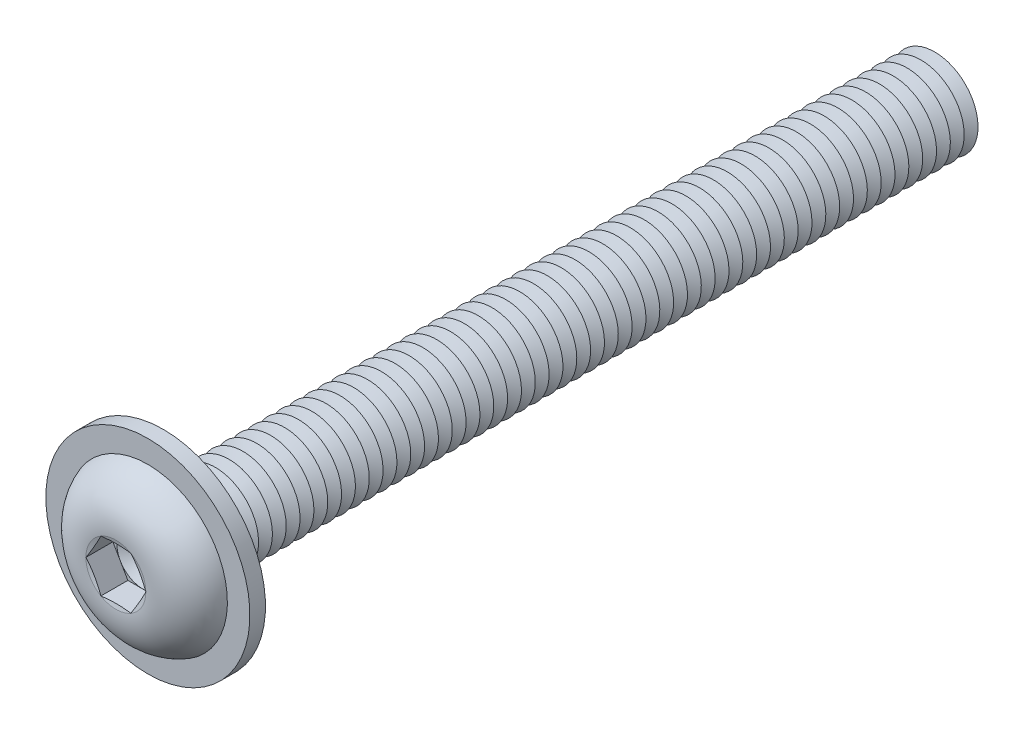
from build123d import *

# Parameters (mm, degrees)
FILLET1_R           = 0.4
LPATTERN1_COUNT     = 56
LPATTERN1_PITCH     = 0.8
CUT_EXTRUDE1_DEPTH  = 1.56
SKETCH5_R           = 5.9
SKETCH5_R_2         = 2.9
BOSS_EXTRUDE1_DEPTH = 0.9


with BuildPart() as part:
    # Sketch1 → Revolve1 (revolve)
    with BuildSketch(Plane(origin=(0, 0, 0), x_dir=(0, 0, -1), z_dir=(1, 0, 0))):
        with BuildLine():
            Line((0, 2.5), (0, 4.75))
            ThreePointArc((0, 4.75), (-2.041477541, 3.848329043), (-2.75, 1.73205))
            Line((-2.75, 1.73205), (-2.517949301, 0.866025))
            Line((-2.517949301, 0.866025), (-2.75, 0.866025))
            Line((-2.75, 0.866025), (-2.75, 0))
            Line((-2.75, 0), (45, 0))
            Line((45, 0), (45, 2.5))
            Line((45, 2.5), (0, 2.5))
        make_face()
    revolve(axis=Axis((0, 0, -45), (0, 0, 1)))

    # Fillet1
    fillet1_edges = [part.edges().sort_by_distance(p)[0] for p in [
        (0, -2.5, 0),
    ]]
    fillet(fillet1_edges, radius=FILLET1_R)

    # Sketch2 → Cut-Revolve1 (revolve, cut)
    with BuildSketch(Plane(origin=(0, 0, 0), x_dir=(0, 0, -1), z_dir=(1, 0, 0))):
        Polygon((44.6, 2.5), (45.4, 2.5), (45, 1.807179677), align=None)
    cut_revolve1 = revolve(axis=Axis((0, 0, -45), (0, 0, -1)), mode=Mode.SUBTRACT)

    # LPattern1: Cut-Revolve1 ×56
    with Locations(*[(0, 0, i * LPATTERN1_PITCH) for i in range(1, LPATTERN1_COUNT)]):
        add(cut_revolve1, mode=Mode.SUBTRACT)

    # Sketch3 → Cut-Extrude1 (cut)
    with BuildSketch(Plane.XY.offset(2.75)):
        Polygon((0.866025, 1.499999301), (-0.866025, 1.499999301), (-1.73205, 0), (-0.866025, -1.499999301), (0.866025, -1.499999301), (1.73205, 0), align=None)
    extrude(amount=-CUT_EXTRUDE1_DEPTH, mode=Mode.SUBTRACT)

    # Cut-Extrude2 cone 1 section (on through the dimple's axis) → Cut-Extrude2 (revolve, cut)
    with BuildSketch(Plane(origin=(0, 0, 1.19), x_dir=(0, -1, 0), z_dir=(1, 0, 0))):
        Polygon((0, 0), (1.499999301, 0), (0, 0.866025), align=None)
    revolve(axis=Axis((0, 0, 1.19), (0, 0, -1)), mode=Mode.SUBTRACT)

    # Sketch5 → Boss-Extrude1 (add)
    with BuildSketch(Plane(origin=(0, 0, 0), x_dir=(-1, 0, 0), z_dir=(0, 0, -1))):
        with Locations(Location((0, 0, 0), (0, 0, 90))):
            Circle(SKETCH5_R)
        Circle(SKETCH5_R_2, mode=Mode.SUBTRACT)
    extrude(amount=-BOSS_EXTRUDE1_DEPTH)


solid = part.part
